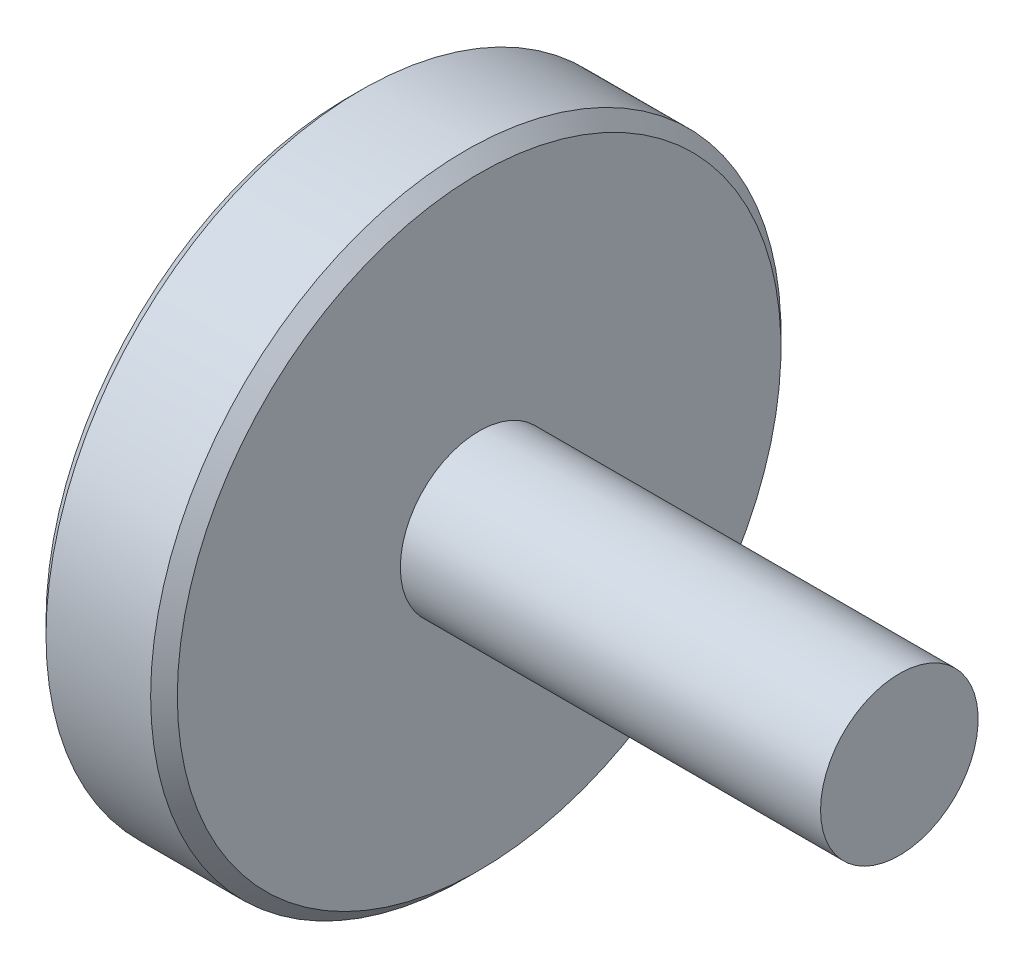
ISO-10303-21;
HEADER;
FILE_DESCRIPTION(('STEP AP214'),'2;1');
FILE_NAME('part.step','',(''),(''),'','','');
FILE_SCHEMA(('AUTOMOTIVE_DESIGN { 1 0 10303 214 1 1 1 1 }'));
ENDSEC;
DATA;
#1=APPLICATION_CONTEXT('core data for automotive mechanical design processes');
#2=APPLICATION_PROTOCOL_DEFINITION('international standard','automotive_design',2000,#1);
#3=PRODUCT_CONTEXT('',#1,'mechanical');
#4=PRODUCT('Part','Part','',(#3));
#5=PRODUCT_RELATED_PRODUCT_CATEGORY('part','',(#4));
#6=PRODUCT_DEFINITION_FORMATION('','',#4);
#7=PRODUCT_DEFINITION_CONTEXT('part definition',#1,'design');
#8=PRODUCT_DEFINITION('design','',#6,#7);
#9=PRODUCT_DEFINITION_SHAPE('','',#8);
#10=(LENGTH_UNIT() NAMED_UNIT(*) SI_UNIT(.MILLI.,.METRE.));
#11=(NAMED_UNIT(*) PLANE_ANGLE_UNIT() SI_UNIT($,.RADIAN.));
#12=(NAMED_UNIT(*) SI_UNIT($,.STERADIAN.) SOLID_ANGLE_UNIT());
#13=UNCERTAINTY_MEASURE_WITH_UNIT(LENGTH_MEASURE(1.E-05),#10,'distance_accuracy_value','');
#14=(GEOMETRIC_REPRESENTATION_CONTEXT(3) GLOBAL_UNCERTAINTY_ASSIGNED_CONTEXT((#13)) GLOBAL_UNIT_ASSIGNED_CONTEXT((#10,
#11,#12)) REPRESENTATION_CONTEXT('',''));
#15=CARTESIAN_POINT('',(0.,0.,0.));
#16=DIRECTION('',(0.,0.,1.));
#17=DIRECTION('',(1.,0.,0.));
#18=AXIS2_PLACEMENT_3D('',#15,#16,#17);
#19=CARTESIAN_POINT('',(10.5,0.,0.));
#20=DIRECTION('',(-1.,0.,0.));
#21=DIRECTION('',(0.,0.,1.));
#22=AXIS2_PLACEMENT_3D('',#19,#20,#21);
#23=CYLINDRICAL_SURFACE('',#22,1.5);
#24=CARTESIAN_POINT('',(10.5,0.,0.));
#25=DIRECTION('',(-1.,0.,0.));
#26=DIRECTION('',(0.,0.,1.));
#27=AXIS2_PLACEMENT_3D('',#24,#25,#26);
#28=CIRCLE('',#27,1.5);
#29=CARTESIAN_POINT('',(10.5,0.,1.5));
#30=VERTEX_POINT('',#29);
#31=EDGE_CURVE('E10',#30,#30,#28,.T.);
#32=ORIENTED_EDGE('',*,*,#31,.T.);
#33=EDGE_LOOP('',(#32));
#34=FACE_BOUND('',#33,.T.);
#35=CARTESIAN_POINT('',(2.5,0.,0.));
#36=DIRECTION('',(-1.,0.,0.));
#37=DIRECTION('',(0.,0.,1.));
#38=AXIS2_PLACEMENT_3D('',#35,#36,#37);
#39=CIRCLE('',#38,1.5);
#40=CARTESIAN_POINT('',(2.5,0.,1.5));
#41=VERTEX_POINT('',#40);
#42=EDGE_CURVE('E53',#41,#41,#39,.T.);
#43=ORIENTED_EDGE('',*,*,#42,.F.);
#44=EDGE_LOOP('',(#43));
#45=FACE_BOUND('',#44,.T.);
#46=ADVANCED_FACE('F31',(#34,#45),#23,.T.);
#47=CARTESIAN_POINT('',(10.5,1.5,0.));
#48=DIRECTION('',(1.,0.,0.));
#49=DIRECTION('',(0.,0.,-1.));
#50=AXIS2_PLACEMENT_3D('',#47,#48,#49);
#51=PLANE('',#50);
#52=ORIENTED_EDGE('',*,*,#31,.F.);
#53=EDGE_LOOP('',(#52));
#54=FACE_BOUND('',#53,.T.);
#55=ADVANCED_FACE('F61',(#54),#51,.T.);
#56=CARTESIAN_POINT('',(0.,0.,0.));
#57=DIRECTION('',(-1.,0.,0.));
#58=DIRECTION('',(0.,0.,1.));
#59=AXIS2_PLACEMENT_3D('',#56,#57,#58);
#60=PLANE('',#59);
#61=CARTESIAN_POINT('',(0.,0.,0.));
#62=DIRECTION('',(-1.,0.,0.));
#63=DIRECTION('',(0.,0.,1.));
#64=AXIS2_PLACEMENT_3D('',#61,#62,#63);
#65=CIRCLE('',#64,5.746);
#66=CARTESIAN_POINT('',(0.,0.,5.746));
#67=VERTEX_POINT('',#66);
#68=EDGE_CURVE('E37',#67,#67,#65,.T.);
#69=ORIENTED_EDGE('',*,*,#68,.T.);
#70=EDGE_LOOP('',(#69));
#71=FACE_BOUND('',#70,.T.);
#72=ADVANCED_FACE('F65',(#71),#60,.T.);
#73=CARTESIAN_POINT('',(0.,0.,0.));
#74=DIRECTION('',(1.,0.,0.));
#75=DIRECTION('',(0.,0.,-1.));
#76=AXIS2_PLACEMENT_3D('',#73,#74,#75);
#77=CONICAL_SURFACE('',#76,5.746,0.785398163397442);
#78=CARTESIAN_POINT('',(0.253999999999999,0.,0.));
#79=DIRECTION('',(-1.,0.,0.));
#80=DIRECTION('',(0.,0.,1.));
#81=AXIS2_PLACEMENT_3D('',#78,#79,#80);
#82=CIRCLE('',#81,6.);
#83=CARTESIAN_POINT('',(0.253999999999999,0.,6.));
#84=VERTEX_POINT('',#83);
#85=EDGE_CURVE('E41',#84,#84,#82,.T.);
#86=ORIENTED_EDGE('',*,*,#85,.T.);
#87=EDGE_LOOP('',(#86));
#88=FACE_BOUND('',#87,.T.);
#89=ORIENTED_EDGE('',*,*,#68,.F.);
#90=EDGE_LOOP('',(#89));
#91=FACE_BOUND('',#90,.T.);
#92=ADVANCED_FACE('F70',(#88,#91),#77,.T.);
#93=CARTESIAN_POINT('',(10.5,0.,0.));
#94=DIRECTION('',(-1.,0.,0.));
#95=DIRECTION('',(0.,0.,1.));
#96=AXIS2_PLACEMENT_3D('',#93,#94,#95);
#97=CYLINDRICAL_SURFACE('',#96,6.);
#98=CARTESIAN_POINT('',(2.246,0.,0.));
#99=DIRECTION('',(-1.,0.,0.));
#100=DIRECTION('',(0.,0.,1.));
#101=AXIS2_PLACEMENT_3D('',#98,#99,#100);
#102=CIRCLE('',#101,6.);
#103=CARTESIAN_POINT('',(2.246,0.,6.));
#104=VERTEX_POINT('',#103);
#105=EDGE_CURVE('E45',#104,#104,#102,.T.);
#106=ORIENTED_EDGE('',*,*,#105,.T.);
#107=EDGE_LOOP('',(#106));
#108=FACE_BOUND('',#107,.T.);
#109=ORIENTED_EDGE('',*,*,#85,.F.);
#110=EDGE_LOOP('',(#109));
#111=FACE_BOUND('',#110,.T.);
#112=ADVANCED_FACE('F75',(#108,#111),#97,.T.);
#113=CARTESIAN_POINT('',(2.246,0.,0.));
#114=DIRECTION('',(-1.,0.,0.));
#115=DIRECTION('',(0.,0.,1.));
#116=AXIS2_PLACEMENT_3D('',#113,#114,#115);
#117=CONICAL_SURFACE('',#116,6.,0.785398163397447);
#118=CARTESIAN_POINT('',(2.5,0.,0.));
#119=DIRECTION('',(-1.,0.,0.));
#120=DIRECTION('',(0.,0.,1.));
#121=AXIS2_PLACEMENT_3D('',#118,#119,#120);
#122=CIRCLE('',#121,5.746);
#123=CARTESIAN_POINT('',(2.5,0.,5.746));
#124=VERTEX_POINT('',#123);
#125=EDGE_CURVE('E50',#124,#124,#122,.T.);
#126=ORIENTED_EDGE('',*,*,#125,.T.);
#127=EDGE_LOOP('',(#126));
#128=FACE_BOUND('',#127,.T.);
#129=ORIENTED_EDGE('',*,*,#105,.F.);
#130=EDGE_LOOP('',(#129));
#131=FACE_BOUND('',#130,.T.);
#132=ADVANCED_FACE('F79',(#128,#131),#117,.T.);
#133=CARTESIAN_POINT('',(2.5,5.746,0.));
#134=DIRECTION('',(1.,0.,0.));
#135=DIRECTION('',(0.,0.,-1.));
#136=AXIS2_PLACEMENT_3D('',#133,#134,#135);
#137=PLANE('',#136);
#138=ORIENTED_EDGE('',*,*,#42,.T.);
#139=EDGE_LOOP('',(#138));
#140=FACE_BOUND('',#139,.T.);
#141=ORIENTED_EDGE('',*,*,#125,.F.);
#142=EDGE_LOOP('',(#141));
#143=FACE_BOUND('',#142,.T.);
#144=ADVANCED_FACE('F57',(#140,#143),#137,.T.);
#145=CLOSED_SHELL('',(#46,#55,#72,#92,#112,#132,#144));
#146=MANIFOLD_SOLID_BREP('B2',#145);
#147=ADVANCED_BREP_SHAPE_REPRESENTATION('',(#18,#146),#14);
#148=SHAPE_DEFINITION_REPRESENTATION(#9,#147);
ENDSEC;
END-ISO-10303-21;
